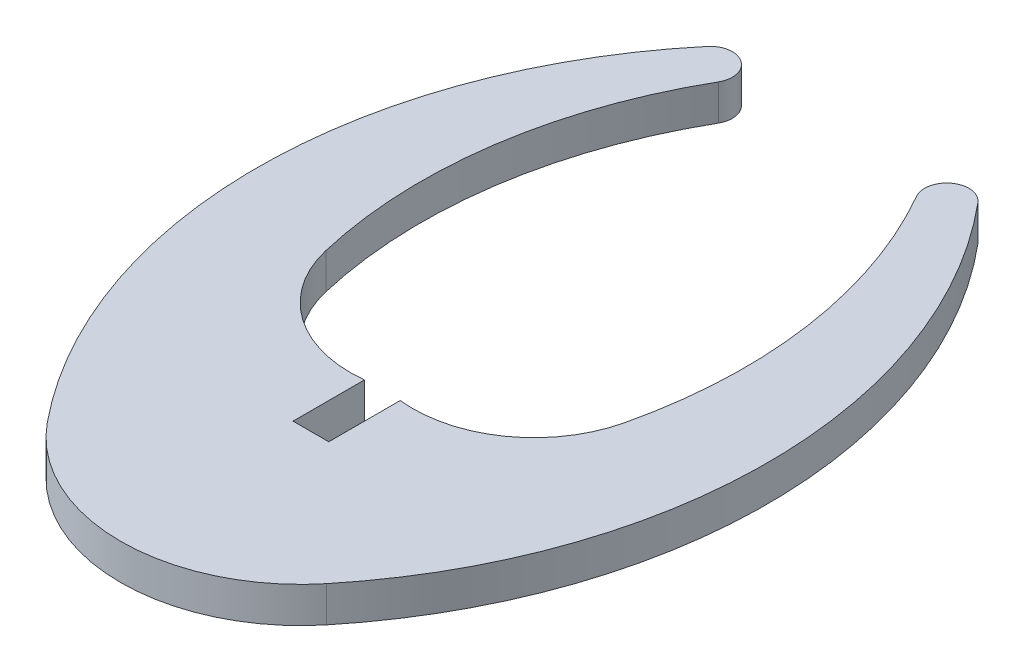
ISO-10303-21;
HEADER;
FILE_DESCRIPTION(('STEP AP214'),'2;1');
FILE_NAME('part.step','',(''),(''),'','','');
FILE_SCHEMA(('AUTOMOTIVE_DESIGN { 1 0 10303 214 1 1 1 1 }'));
ENDSEC;
DATA;
#1=APPLICATION_CONTEXT('core data for automotive mechanical design processes');
#2=APPLICATION_PROTOCOL_DEFINITION('international standard','automotive_design',2000,#1);
#3=PRODUCT_CONTEXT('',#1,'mechanical');
#4=PRODUCT('Part','Part','',(#3));
#5=PRODUCT_RELATED_PRODUCT_CATEGORY('part','',(#4));
#6=PRODUCT_DEFINITION_FORMATION('','',#4);
#7=PRODUCT_DEFINITION_CONTEXT('part definition',#1,'design');
#8=PRODUCT_DEFINITION('design','',#6,#7);
#9=PRODUCT_DEFINITION_SHAPE('','',#8);
#10=(LENGTH_UNIT() NAMED_UNIT(*) SI_UNIT(.MILLI.,.METRE.));
#11=(NAMED_UNIT(*) PLANE_ANGLE_UNIT() SI_UNIT($,.RADIAN.));
#12=(NAMED_UNIT(*) SI_UNIT($,.STERADIAN.) SOLID_ANGLE_UNIT());
#13=UNCERTAINTY_MEASURE_WITH_UNIT(LENGTH_MEASURE(1.E-05),#10,'distance_accuracy_value','');
#14=(GEOMETRIC_REPRESENTATION_CONTEXT(3) GLOBAL_UNCERTAINTY_ASSIGNED_CONTEXT((#13)) GLOBAL_UNIT_ASSIGNED_CONTEXT((#10,
#11,#12)) REPRESENTATION_CONTEXT('',''));
#15=CARTESIAN_POINT('',(0.,0.,0.));
#16=DIRECTION('',(0.,0.,1.));
#17=DIRECTION('',(1.,0.,0.));
#18=AXIS2_PLACEMENT_3D('',#15,#16,#17);
#19=CARTESIAN_POINT('',(-41945.935572,3.,-18357.862013));
#20=DIRECTION('',(-0.999999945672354,0.,0.000329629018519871));
#21=DIRECTION('',(0.000329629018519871,0.,0.999999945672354));
#22=AXIS2_PLACEMENT_3D('',#19,#20,#21);
#23=PLANE('',#22);
#24=DIRECTION('',(-0.000329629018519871,0.,-0.999999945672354));
#25=VECTOR('',#24,1.);
#26=CARTESIAN_POINT('',(-41945.935572,0.,-18357.862013));
#27=LINE('',#26,#25);
#28=CARTESIAN_POINT('',(-41945.933594,0.,-18351.861328));
#29=VERTEX_POINT('',#28);
#30=CARTESIAN_POINT('',(-41945.935572,0.,-18357.862013));
#31=VERTEX_POINT('',#30);
#32=EDGE_CURVE('E156',#29,#31,#27,.T.);
#33=ORIENTED_EDGE('',*,*,#32,.T.);
#34=DIRECTION('',(0.,-1.,0.));
#35=VECTOR('',#34,1.);
#36=CARTESIAN_POINT('',(-41945.935572,3.,-18357.862013));
#37=LINE('',#36,#35);
#38=CARTESIAN_POINT('',(-41945.935572,3.,-18357.862013));
#39=VERTEX_POINT('',#38);
#40=EDGE_CURVE('E11',#39,#31,#37,.T.);
#41=ORIENTED_EDGE('',*,*,#40,.F.);
#42=DIRECTION('',(-0.000329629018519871,0.,-0.999999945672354));
#43=VECTOR('',#42,1.);
#44=CARTESIAN_POINT('',(-41945.935572,3.,-18357.862013));
#45=LINE('',#44,#43);
#46=CARTESIAN_POINT('',(-41945.933594,3.,-18351.861328));
#47=VERTEX_POINT('',#46);
#48=EDGE_CURVE('E178',#47,#39,#45,.T.);
#49=ORIENTED_EDGE('',*,*,#48,.F.);
#50=DIRECTION('',(0.,-1.,0.));
#51=VECTOR('',#50,1.);
#52=CARTESIAN_POINT('',(-41945.933594,3.,-18351.861328));
#53=LINE('',#52,#51);
#54=EDGE_CURVE('E152',#47,#29,#53,.T.);
#55=ORIENTED_EDGE('',*,*,#54,.T.);
#56=EDGE_LOOP('',(#33,#41,#49,#55));
#57=FACE_BOUND('',#56,.T.);
#58=ADVANCED_FACE('F36',(#57),#23,.F.);
#59=CARTESIAN_POINT('',(-41947.0649977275,3.,-18367.9618966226));
#60=DIRECTION('',(0.,-1.,0.));
#61=DIRECTION('',(0.,0.,-1.));
#62=AXIS2_PLACEMENT_3D('',#59,#60,#61);
#63=CYLINDRICAL_SURFACE('',#62,10.1628367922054);
#64=CARTESIAN_POINT('',(-41947.0649977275,0.,-18367.9618966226));
#65=DIRECTION('',(0.,-1.,0.));
#66=DIRECTION('',(0.,0.,1.));
#67=AXIS2_PLACEMENT_3D('',#64,#65,#66);
#68=CIRCLE('',#67,10.1628367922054);
#69=CARTESIAN_POINT('',(-41956.960626,0.,-18365.646774));
#70=VERTEX_POINT('',#69);
#71=EDGE_CURVE('E159',#31,#70,#68,.T.);
#72=ORIENTED_EDGE('',*,*,#71,.T.);
#73=DIRECTION('',(0.,-1.,0.));
#74=VECTOR('',#73,1.);
#75=CARTESIAN_POINT('',(-41956.960626,3.,-18365.646774));
#76=LINE('',#75,#74);
#77=CARTESIAN_POINT('',(-41956.960626,3.,-18365.646774));
#78=VERTEX_POINT('',#77);
#79=EDGE_CURVE('E44',#78,#70,#76,.T.);
#80=ORIENTED_EDGE('',*,*,#79,.F.);
#81=CARTESIAN_POINT('',(-41947.0649977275,3.,-18367.9618966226));
#82=DIRECTION('',(0.,-1.,0.));
#83=DIRECTION('',(0.,0.,1.));
#84=AXIS2_PLACEMENT_3D('',#81,#82,#83);
#85=CIRCLE('',#84,10.1628367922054);
#86=EDGE_CURVE('E107',#39,#78,#85,.T.);
#87=ORIENTED_EDGE('',*,*,#86,.F.);
#88=ORIENTED_EDGE('',*,*,#40,.T.);
#89=EDGE_LOOP('',(#72,#80,#87,#88));
#90=FACE_BOUND('',#89,.T.);
#91=ADVANCED_FACE('F256',(#90),#63,.F.);
#92=CARTESIAN_POINT('',(-41918.4104897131,3.,-18374.6735051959));
#93=DIRECTION('',(0.,-1.,0.));
#94=DIRECTION('',(0.,0.,-1.));
#95=AXIS2_PLACEMENT_3D('',#92,#93,#94);
#96=CYLINDRICAL_SURFACE('',#95,39.592864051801);
#97=CARTESIAN_POINT('',(-41918.4104897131,0.,-18374.6735051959));
#98=DIRECTION('',(0.,-1.,0.));
#99=DIRECTION('',(0.,0.,1.));
#100=AXIS2_PLACEMENT_3D('',#97,#98,#99);
#101=CIRCLE('',#100,39.592864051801);
#102=CARTESIAN_POINT('',(-41952.74617,0.,-18394.387864));
#103=VERTEX_POINT('',#102);
#104=EDGE_CURVE('E161',#70,#103,#101,.T.);
#105=ORIENTED_EDGE('',*,*,#104,.T.);
#106=DIRECTION('',(0.,-1.,0.));
#107=VECTOR('',#106,1.);
#108=CARTESIAN_POINT('',(-41952.74617,3.,-18394.387864));
#109=LINE('',#108,#107);
#110=CARTESIAN_POINT('',(-41952.74617,3.,-18394.387864));
#111=VERTEX_POINT('',#110);
#112=EDGE_CURVE('E197',#111,#103,#109,.T.);
#113=ORIENTED_EDGE('',*,*,#112,.F.);
#114=CARTESIAN_POINT('',(-41918.4104897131,3.,-18374.6735051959));
#115=DIRECTION('',(0.,-1.,0.));
#116=DIRECTION('',(0.,0.,1.));
#117=AXIS2_PLACEMENT_3D('',#114,#115,#116);
#118=CIRCLE('',#117,39.592864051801);
#119=EDGE_CURVE('E205',#78,#111,#118,.T.);
#120=ORIENTED_EDGE('',*,*,#119,.F.);
#121=ORIENTED_EDGE('',*,*,#79,.T.);
#122=EDGE_LOOP('',(#105,#113,#120,#121));
#123=FACE_BOUND('',#122,.T.);
#124=ADVANCED_FACE('F203',(#123),#96,.F.);
#125=CARTESIAN_POINT('',(-41954.3597937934,3.,-18395.3127918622));
#126=DIRECTION('',(0.,-1.,0.));
#127=DIRECTION('',(0.,0.,-1.));
#128=AXIS2_PLACEMENT_3D('',#125,#126,#127);
#129=CYLINDRICAL_SURFACE('',#128,1.85991217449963);
#130=CARTESIAN_POINT('',(-41954.3597937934,0.,-18395.3127918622));
#131=DIRECTION('',(0.,1.,0.));
#132=DIRECTION('',(0.,0.,1.));
#133=AXIS2_PLACEMENT_3D('',#130,#131,#132);
#134=CIRCLE('',#133,1.85991217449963);
#135=CARTESIAN_POINT('',(-41955.786134,0.,-18396.506453));
#136=VERTEX_POINT('',#135);
#137=EDGE_CURVE('E163',#103,#136,#134,.T.);
#138=ORIENTED_EDGE('',*,*,#137,.T.);
#139=DIRECTION('',(0.,-1.,0.));
#140=VECTOR('',#139,1.);
#141=CARTESIAN_POINT('',(-41955.786134,3.,-18396.506453));
#142=LINE('',#141,#140);
#143=CARTESIAN_POINT('',(-41955.786134,3.,-18396.506453));
#144=VERTEX_POINT('',#143);
#145=EDGE_CURVE('E194',#144,#136,#142,.T.);
#146=ORIENTED_EDGE('',*,*,#145,.F.);
#147=CARTESIAN_POINT('',(-41954.3597937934,3.,-18395.3127918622));
#148=DIRECTION('',(0.,1.,0.));
#149=DIRECTION('',(0.,0.,1.));
#150=AXIS2_PLACEMENT_3D('',#147,#148,#149);
#151=CIRCLE('',#150,1.85991217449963);
#152=EDGE_CURVE('E223',#111,#144,#151,.T.);
#153=ORIENTED_EDGE('',*,*,#152,.F.);
#154=ORIENTED_EDGE('',*,*,#112,.T.);
#155=EDGE_LOOP('',(#138,#146,#153,#154));
#156=FACE_BOUND('',#155,.T.);
#157=ADVANCED_FACE('F214',(#156),#129,.T.);
#158=CARTESIAN_POINT('',(-41922.6640580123,3.,-18368.7544924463));
#159=DIRECTION('',(0.,-1.,0.));
#160=DIRECTION('',(0.,0.,-1.));
#161=AXIS2_PLACEMENT_3D('',#158,#159,#160);
#162=CYLINDRICAL_SURFACE('',#161,43.2116099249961);
#163=CARTESIAN_POINT('',(-41922.6640580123,0.,-18368.7544924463));
#164=DIRECTION('',(0.,1.,0.));
#165=DIRECTION('',(0.,0.,1.));
#166=AXIS2_PLACEMENT_3D('',#163,#164,#165);
#167=CIRCLE('',#166,43.2116099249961);
#168=CARTESIAN_POINT('',(-41956.160465,0.,-18341.455519));
#169=VERTEX_POINT('',#168);
#170=EDGE_CURVE('E165',#136,#169,#167,.T.);
#171=ORIENTED_EDGE('',*,*,#170,.T.);
#172=DIRECTION('',(0.,-1.,0.));
#173=VECTOR('',#172,1.);
#174=CARTESIAN_POINT('',(-41956.160465,3.,-18341.455519));
#175=LINE('',#174,#173);
#176=CARTESIAN_POINT('',(-41956.160465,3.,-18341.455519));
#177=VERTEX_POINT('',#176);
#178=EDGE_CURVE('E191',#177,#169,#175,.T.);
#179=ORIENTED_EDGE('',*,*,#178,.F.);
#180=CARTESIAN_POINT('',(-41922.6640580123,3.,-18368.7544924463));
#181=DIRECTION('',(0.,1.,0.));
#182=DIRECTION('',(0.,0.,1.));
#183=AXIS2_PLACEMENT_3D('',#180,#181,#182);
#184=CIRCLE('',#183,43.2116099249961);
#185=EDGE_CURVE('E220',#144,#177,#184,.T.);
#186=ORIENTED_EDGE('',*,*,#185,.F.);
#187=ORIENTED_EDGE('',*,*,#145,.T.);
#188=EDGE_LOOP('',(#171,#179,#186,#187));
#189=FACE_BOUND('',#188,.T.);
#190=ADVANCED_FACE('F218',(#189),#162,.T.);
#191=CARTESIAN_POINT('',(-41944.434343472,3.,-18351.0136722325));
#192=DIRECTION('',(0.,-1.,0.));
#193=DIRECTION('',(0.,0.,-1.));
#194=AXIS2_PLACEMENT_3D('',#191,#192,#193);
#195=CYLINDRICAL_SURFACE('',#194,15.1281267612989);
#196=CARTESIAN_POINT('',(-41944.434343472,0.,-18351.0136722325));
#197=DIRECTION('',(0.,1.,0.));
#198=DIRECTION('',(0.,0.,1.));
#199=AXIS2_PLACEMENT_3D('',#196,#197,#198);
#200=CIRCLE('',#199,15.1281267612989);
#201=CARTESIAN_POINT('',(-41932.710314,0.,-18341.452953));
#202=VERTEX_POINT('',#201);
#203=EDGE_CURVE('E167',#169,#202,#200,.T.);
#204=ORIENTED_EDGE('',*,*,#203,.T.);
#205=DIRECTION('',(0.,-1.,0.));
#206=VECTOR('',#205,1.);
#207=CARTESIAN_POINT('',(-41932.710314,3.,-18341.452953));
#208=LINE('',#207,#206);
#209=CARTESIAN_POINT('',(-41932.710314,3.,-18341.452953));
#210=VERTEX_POINT('',#209);
#211=EDGE_CURVE('E188',#210,#202,#208,.T.);
#212=ORIENTED_EDGE('',*,*,#211,.F.);
#213=CARTESIAN_POINT('',(-41944.434343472,3.,-18351.0136722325));
#214=DIRECTION('',(0.,1.,0.));
#215=DIRECTION('',(0.,0.,1.));
#216=AXIS2_PLACEMENT_3D('',#213,#214,#215);
#217=CIRCLE('',#216,15.1281267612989);
#218=EDGE_CURVE('E222',#177,#210,#217,.T.);
#219=ORIENTED_EDGE('',*,*,#218,.F.);
#220=ORIENTED_EDGE('',*,*,#178,.T.);
#221=EDGE_LOOP('',(#204,#212,#219,#220));
#222=FACE_BOUND('',#221,.T.);
#223=ADVANCED_FACE('F269',(#222),#195,.T.);
#224=CARTESIAN_POINT('',(-41966.1992058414,3.,-18368.7597147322));
#225=DIRECTION('',(0.,-1.,0.));
#226=DIRECTION('',(0.,0.,-1.));
#227=AXIS2_PLACEMENT_3D('',#224,#225,#226);
#228=CYLINDRICAL_SURFACE('',#227,43.2107060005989);
#229=CARTESIAN_POINT('',(-41966.1992058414,0.,-18368.7597147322));
#230=DIRECTION('',(0.,1.,0.));
#231=DIRECTION('',(0.,0.,1.));
#232=AXIS2_PLACEMENT_3D('',#229,#230,#231);
#233=CIRCLE('',#232,43.2107060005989);
#234=CARTESIAN_POINT('',(-41933.071738,0.,-18396.503831));
#235=VERTEX_POINT('',#234);
#236=EDGE_CURVE('E169',#202,#235,#233,.T.);
#237=ORIENTED_EDGE('',*,*,#236,.T.);
#238=DIRECTION('',(0.,-1.,0.));
#239=VECTOR('',#238,1.);
#240=CARTESIAN_POINT('',(-41933.071738,3.,-18396.503831));
#241=LINE('',#240,#239);
#242=CARTESIAN_POINT('',(-41933.071738,3.,-18396.503831));
#243=VERTEX_POINT('',#242);
#244=EDGE_CURVE('E185',#243,#235,#241,.T.);
#245=ORIENTED_EDGE('',*,*,#244,.F.);
#246=CARTESIAN_POINT('',(-41966.1992058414,3.,-18368.7597147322));
#247=DIRECTION('',(0.,1.,0.));
#248=DIRECTION('',(0.,0.,1.));
#249=AXIS2_PLACEMENT_3D('',#246,#247,#248);
#250=CIRCLE('',#249,43.2107060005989);
#251=EDGE_CURVE('E225',#210,#243,#250,.T.);
#252=ORIENTED_EDGE('',*,*,#251,.F.);
#253=ORIENTED_EDGE('',*,*,#211,.T.);
#254=EDGE_LOOP('',(#237,#245,#252,#253));
#255=FACE_BOUND('',#254,.T.);
#256=ADVANCED_FACE('F272',(#255),#228,.T.);
#257=CARTESIAN_POINT('',(-41934.4943927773,3.,-18395.3097814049));
#258=DIRECTION('',(0.,-1.,0.));
#259=DIRECTION('',(0.,0.,-1.));
#260=AXIS2_PLACEMENT_3D('',#257,#258,#259);
#261=CYLINDRICAL_SURFACE('',#260,1.85733708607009);
#262=CARTESIAN_POINT('',(-41934.4943927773,0.,-18395.3097814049));
#263=DIRECTION('',(0.,1.,0.));
#264=DIRECTION('',(0.,0.,1.));
#265=AXIS2_PLACEMENT_3D('',#262,#263,#264);
#266=CIRCLE('',#265,1.85733708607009);
#267=CARTESIAN_POINT('',(-41936.105791,0.,-18394.386149));
#268=VERTEX_POINT('',#267);
#269=EDGE_CURVE('E171',#235,#268,#266,.T.);
#270=ORIENTED_EDGE('',*,*,#269,.T.);
#271=DIRECTION('',(0.,-1.,0.));
#272=VECTOR('',#271,1.);
#273=CARTESIAN_POINT('',(-41936.105791,3.,-18394.386149));
#274=LINE('',#273,#272);
#275=CARTESIAN_POINT('',(-41936.105791,3.,-18394.386149));
#276=VERTEX_POINT('',#275);
#277=EDGE_CURVE('E182',#276,#268,#274,.T.);
#278=ORIENTED_EDGE('',*,*,#277,.F.);
#279=CARTESIAN_POINT('',(-41934.4943927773,3.,-18395.3097814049));
#280=DIRECTION('',(0.,1.,0.));
#281=DIRECTION('',(0.,0.,1.));
#282=AXIS2_PLACEMENT_3D('',#279,#280,#281);
#283=CIRCLE('',#282,1.85733708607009);
#284=EDGE_CURVE('E231',#243,#276,#283,.T.);
#285=ORIENTED_EDGE('',*,*,#284,.F.);
#286=ORIENTED_EDGE('',*,*,#244,.T.);
#287=EDGE_LOOP('',(#270,#278,#285,#286));
#288=FACE_BOUND('',#287,.T.);
#289=ADVANCED_FACE('F237',(#288),#261,.T.);
#290=CARTESIAN_POINT('',(-41970.4499157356,3.,-18374.6883607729));
#291=DIRECTION('',(0.,-1.,0.));
#292=DIRECTION('',(0.,0.,-1.));
#293=AXIS2_PLACEMENT_3D('',#290,#291,#292);
#294=CYLINDRICAL_SURFACE('',#293,39.591940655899);
#295=CARTESIAN_POINT('',(-41970.4499157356,0.,-18374.6883607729));
#296=DIRECTION('',(0.,-1.,0.));
#297=DIRECTION('',(0.,0.,1.));
#298=AXIS2_PLACEMENT_3D('',#295,#296,#297);
#299=CIRCLE('',#298,39.591940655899);
#300=CARTESIAN_POINT('',(-41931.904757,0.,-18365.64444));
#301=VERTEX_POINT('',#300);
#302=EDGE_CURVE('E173',#268,#301,#299,.T.);
#303=ORIENTED_EDGE('',*,*,#302,.T.);
#304=DIRECTION('',(0.,-1.,0.));
#305=VECTOR('',#304,1.);
#306=CARTESIAN_POINT('',(-41931.904757,3.,-18365.64444));
#307=LINE('',#306,#305);
#308=CARTESIAN_POINT('',(-41931.904757,3.,-18365.64444));
#309=VERTEX_POINT('',#308);
#310=EDGE_CURVE('E147',#309,#301,#307,.T.);
#311=ORIENTED_EDGE('',*,*,#310,.F.);
#312=CARTESIAN_POINT('',(-41970.4499157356,3.,-18374.6883607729));
#313=DIRECTION('',(0.,-1.,0.));
#314=DIRECTION('',(0.,0.,1.));
#315=AXIS2_PLACEMENT_3D('',#312,#313,#314);
#316=CIRCLE('',#315,39.591940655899);
#317=EDGE_CURVE('E138',#276,#309,#316,.T.);
#318=ORIENTED_EDGE('',*,*,#317,.F.);
#319=ORIENTED_EDGE('',*,*,#277,.T.);
#320=EDGE_LOOP('',(#303,#311,#318,#319));
#321=FACE_BOUND('',#320,.T.);
#322=ADVANCED_FACE('F241',(#321),#294,.F.);
#323=CARTESIAN_POINT('',(-41941.8013358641,3.,-18367.9624994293));
#324=DIRECTION('',(0.,-1.,0.));
#325=DIRECTION('',(0.,0.,-1.));
#326=AXIS2_PLACEMENT_3D('',#323,#324,#325);
#327=CYLINDRICAL_SURFACE('',#326,10.1644317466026);
#328=CARTESIAN_POINT('',(-41941.8013358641,0.,-18367.9624994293));
#329=DIRECTION('',(0.,-1.,0.));
#330=DIRECTION('',(0.,0.,1.));
#331=AXIS2_PLACEMENT_3D('',#328,#329,#330);
#332=CIRCLE('',#331,10.1644317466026);
#333=CARTESIAN_POINT('',(-41942.933594,0.,-18357.861328));
#334=VERTEX_POINT('',#333);
#335=EDGE_CURVE('E146',#301,#334,#332,.T.);
#336=ORIENTED_EDGE('',*,*,#335,.T.);
#337=DIRECTION('',(0.,-1.,0.));
#338=VECTOR('',#337,1.);
#339=CARTESIAN_POINT('',(-41942.933594,3.,-18357.861328));
#340=LINE('',#339,#338);
#341=CARTESIAN_POINT('',(-41942.933594,3.,-18357.861328));
#342=VERTEX_POINT('',#341);
#343=EDGE_CURVE('E143',#342,#334,#340,.T.);
#344=ORIENTED_EDGE('',*,*,#343,.F.);
#345=CARTESIAN_POINT('',(-41941.8013358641,3.,-18367.9624994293));
#346=DIRECTION('',(0.,-1.,0.));
#347=DIRECTION('',(0.,0.,1.));
#348=AXIS2_PLACEMENT_3D('',#345,#346,#347);
#349=CIRCLE('',#348,10.1644317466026);
#350=EDGE_CURVE('E132',#309,#342,#349,.T.);
#351=ORIENTED_EDGE('',*,*,#350,.F.);
#352=ORIENTED_EDGE('',*,*,#310,.T.);
#353=EDGE_LOOP('',(#336,#344,#351,#352));
#354=FACE_BOUND('',#353,.T.);
#355=ADVANCED_FACE('F144',(#354),#327,.F.);
#356=CARTESIAN_POINT('',(-41942.933594,3.,-18351.861328));
#357=DIRECTION('',(1.,0.,0.));
#358=DIRECTION('',(0.,0.,-1.));
#359=AXIS2_PLACEMENT_3D('',#356,#357,#358);
#360=PLANE('',#359);
#361=DIRECTION('',(0.,0.,1.));
#362=VECTOR('',#361,1.);
#363=CARTESIAN_POINT('',(-41942.933594,0.,-18351.861328));
#364=LINE('',#363,#362);
#365=CARTESIAN_POINT('',(-41942.933594,0.,-18351.861328));
#366=VERTEX_POINT('',#365);
#367=EDGE_CURVE('E93',#334,#366,#364,.T.);
#368=ORIENTED_EDGE('',*,*,#367,.T.);
#369=DIRECTION('',(0.,-1.,0.));
#370=VECTOR('',#369,1.);
#371=CARTESIAN_POINT('',(-41942.933594,3.,-18351.861328));
#372=LINE('',#371,#370);
#373=CARTESIAN_POINT('',(-41942.933594,3.,-18351.861328));
#374=VERTEX_POINT('',#373);
#375=EDGE_CURVE('E148',#374,#366,#372,.T.);
#376=ORIENTED_EDGE('',*,*,#375,.F.);
#377=DIRECTION('',(0.,0.,1.));
#378=VECTOR('',#377,1.);
#379=CARTESIAN_POINT('',(-41942.933594,3.,-18351.861328));
#380=LINE('',#379,#378);
#381=EDGE_CURVE('E136',#342,#374,#380,.T.);
#382=ORIENTED_EDGE('',*,*,#381,.F.);
#383=ORIENTED_EDGE('',*,*,#343,.T.);
#384=EDGE_LOOP('',(#368,#376,#382,#383));
#385=FACE_BOUND('',#384,.T.);
#386=ADVANCED_FACE('F150',(#385),#360,.F.);
#387=CARTESIAN_POINT('',(-41945.933594,3.,-18351.861328));
#388=DIRECTION('',(0.,0.,1.));
#389=DIRECTION('',(1.,0.,0.));
#390=AXIS2_PLACEMENT_3D('',#387,#388,#389);
#391=PLANE('',#390);
#392=DIRECTION('',(-1.,0.,0.));
#393=VECTOR('',#392,1.);
#394=CARTESIAN_POINT('',(-41945.933594,0.,-18351.861328));
#395=LINE('',#394,#393);
#396=EDGE_CURVE('E99',#366,#29,#395,.T.);
#397=ORIENTED_EDGE('',*,*,#396,.T.);
#398=ORIENTED_EDGE('',*,*,#54,.F.);
#399=DIRECTION('',(-1.,0.,0.));
#400=VECTOR('',#399,1.);
#401=CARTESIAN_POINT('',(-41945.933594,3.,-18351.861328));
#402=LINE('',#401,#400);
#403=EDGE_CURVE('E52',#374,#47,#402,.T.);
#404=ORIENTED_EDGE('',*,*,#403,.F.);
#405=ORIENTED_EDGE('',*,*,#375,.T.);
#406=EDGE_LOOP('',(#397,#398,#404,#405));
#407=FACE_BOUND('',#406,.T.);
#408=ADVANCED_FACE('F245',(#407),#391,.F.);
#409=CARTESIAN_POINT('',(-41941.8013358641,3.,-18367.9624994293));
#410=DIRECTION('',(0.,1.,0.));
#411=DIRECTION('',(0.,0.,1.));
#412=AXIS2_PLACEMENT_3D('',#409,#410,#411);
#413=PLANE('',#412);
#414=ORIENTED_EDGE('',*,*,#48,.T.);
#415=ORIENTED_EDGE('',*,*,#86,.T.);
#416=ORIENTED_EDGE('',*,*,#119,.T.);
#417=ORIENTED_EDGE('',*,*,#152,.T.);
#418=ORIENTED_EDGE('',*,*,#185,.T.);
#419=ORIENTED_EDGE('',*,*,#218,.T.);
#420=ORIENTED_EDGE('',*,*,#251,.T.);
#421=ORIENTED_EDGE('',*,*,#284,.T.);
#422=ORIENTED_EDGE('',*,*,#317,.T.);
#423=ORIENTED_EDGE('',*,*,#350,.T.);
#424=ORIENTED_EDGE('',*,*,#381,.T.);
#425=ORIENTED_EDGE('',*,*,#403,.T.);
#426=EDGE_LOOP('',(#414,#415,#416,#417,#418,#419,#420,#421,#422,#423,#424,#425));
#427=FACE_BOUND('',#426,.T.);
#428=ADVANCED_FACE('F134',(#427),#413,.T.);
#429=CARTESIAN_POINT('',(-41941.8013358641,0.,-18367.9624994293));
#430=DIRECTION('',(0.,1.,0.));
#431=DIRECTION('',(0.,0.,1.));
#432=AXIS2_PLACEMENT_3D('',#429,#430,#431);
#433=PLANE('',#432);
#434=ORIENTED_EDGE('',*,*,#32,.F.);
#435=ORIENTED_EDGE('',*,*,#396,.F.);
#436=ORIENTED_EDGE('',*,*,#367,.F.);
#437=ORIENTED_EDGE('',*,*,#335,.F.);
#438=ORIENTED_EDGE('',*,*,#302,.F.);
#439=ORIENTED_EDGE('',*,*,#269,.F.);
#440=ORIENTED_EDGE('',*,*,#236,.F.);
#441=ORIENTED_EDGE('',*,*,#203,.F.);
#442=ORIENTED_EDGE('',*,*,#170,.F.);
#443=ORIENTED_EDGE('',*,*,#137,.F.);
#444=ORIENTED_EDGE('',*,*,#104,.F.);
#445=ORIENTED_EDGE('',*,*,#71,.F.);
#446=EDGE_LOOP('',(#434,#435,#436,#437,#438,#439,#440,#441,#442,#443,#444,#445));
#447=FACE_BOUND('',#446,.T.);
#448=ADVANCED_FACE('F209',(#447),#433,.F.);
#449=CLOSED_SHELL('',(#58,#91,#124,#157,#190,#223,#256,#289,#322,#355,#386,#408,#428,#448));
#450=MANIFOLD_SOLID_BREP('B2',#449);
#451=ADVANCED_BREP_SHAPE_REPRESENTATION('',(#18,#450),#14);
#452=SHAPE_DEFINITION_REPRESENTATION(#9,#451);
ENDSEC;
END-ISO-10303-21;
